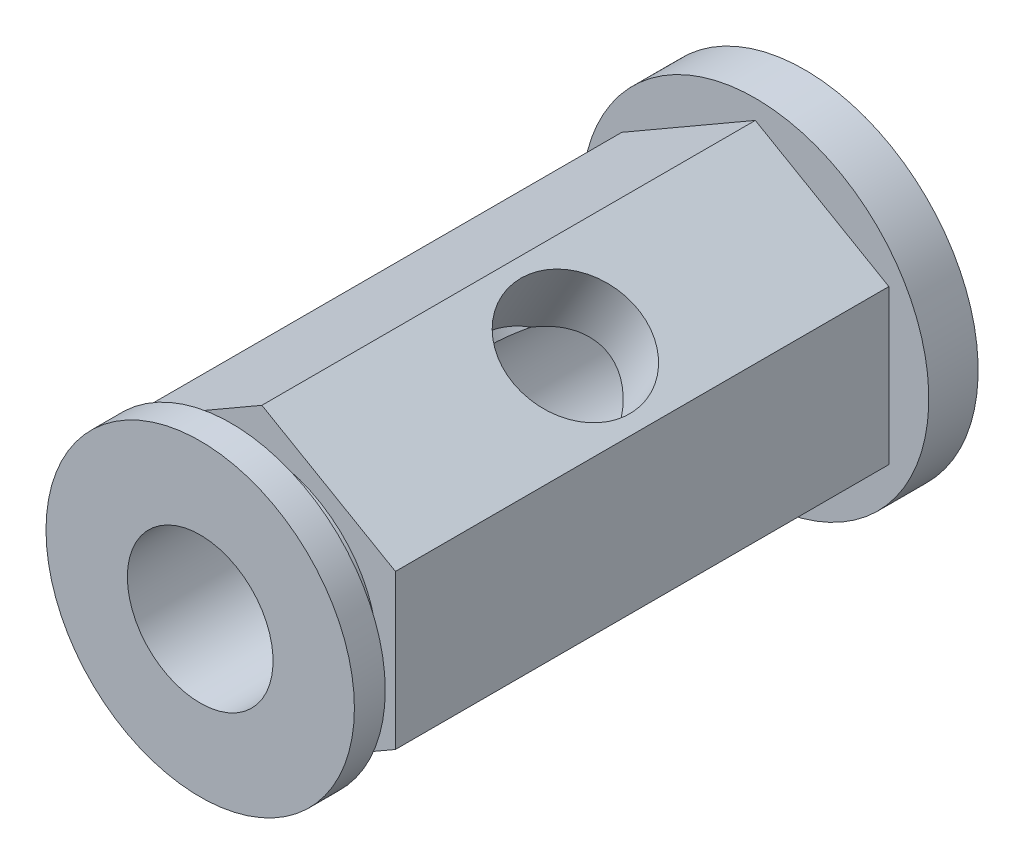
from build123d import *

# Parameters (mm, degrees)
BOSS_EXTRUDE1_DEPTH            = 20.32
SKETCH2_R                      = 7.14375
BOSS_EXTRUDE2_DEPTH            = 2.032
SKETCH3_R                      = 4.738605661
BOSS_EXTRUDE3_DEPTH            = 1.27
SKETCH4_R                      = 6.35
BOSS_EXTRUDE4_DEPTH            = 1.27
SKETCH5_R                      = 3
CUT_EXTRUDE1_DEPTH             = 27.864065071
F_6_0_204_DIAMETER_HOLE1_D     = 5.1816
F_6_0_204_DIAMETER_HOLE1_DEPTH = 3.302
F_6_0_204_DIAMETER_HOLE1_TIP   = 1.556709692


with BuildPart() as part:
    # Sketch1 → Boss-Extrude1 (new body)
    with BuildSketch(Plane.XY):
        Polygon((0, 6.35), (-5.499261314, 3.175), (-5.499261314, -3.175), (0, -6.35), (5.499261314, -3.175), (5.499261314, 3.175), align=None)
    extrude(amount=BOSS_EXTRUDE1_DEPTH)

    # Sketch2 → Boss-Extrude2 (add)
    with BuildSketch(Plane(origin=(0, 0, 0), x_dir=(-1, 0, 0), z_dir=(0, 0, -1))):
        Circle(SKETCH2_R)
    extrude(amount=BOSS_EXTRUDE2_DEPTH)

    # Sketch3 → Boss-Extrude3 (add)
    with BuildSketch(Plane.XY.offset(20.32)):
        Circle(SKETCH3_R)
    extrude(amount=BOSS_EXTRUDE3_DEPTH)

    # Sketch4 → Boss-Extrude4 (add)
    with BuildSketch(Plane.XY.offset(21.59)):
        Circle(SKETCH4_R)
    extrude(amount=BOSS_EXTRUDE4_DEPTH)

    # Sketch5 → Cut-Extrude1 (cut, through all)
    with BuildSketch(Plane(origin=(0, 0, -2.032), x_dir=(-1, 0, 0), z_dir=(0, 0, -1))):
        Circle(SKETCH5_R)
    extrude(amount=-CUT_EXTRUDE1_DEPTH, mode=Mode.SUBTRACT)

    # 6 _0.204_ Diameter Hole1
    with Locations(Plane(origin=(2.749630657, 4.7625, 0), x_dir=(0.8660254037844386, -0.4999999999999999, 0), z_dir=(0.49999999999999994, 0.8660254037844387, 0))):
        with Locations((0, -10.16)):
            Hole(F_6_0_204_DIAMETER_HOLE1_D / 2, depth=F_6_0_204_DIAMETER_HOLE1_DEPTH)
            with Locations((0, 0, -(F_6_0_204_DIAMETER_HOLE1_DEPTH + F_6_0_204_DIAMETER_HOLE1_TIP / 2))):  # 118° drill point
                Cone(0, F_6_0_204_DIAMETER_HOLE1_D / 2, F_6_0_204_DIAMETER_HOLE1_TIP, mode=Mode.SUBTRACT)


solid = part.part
